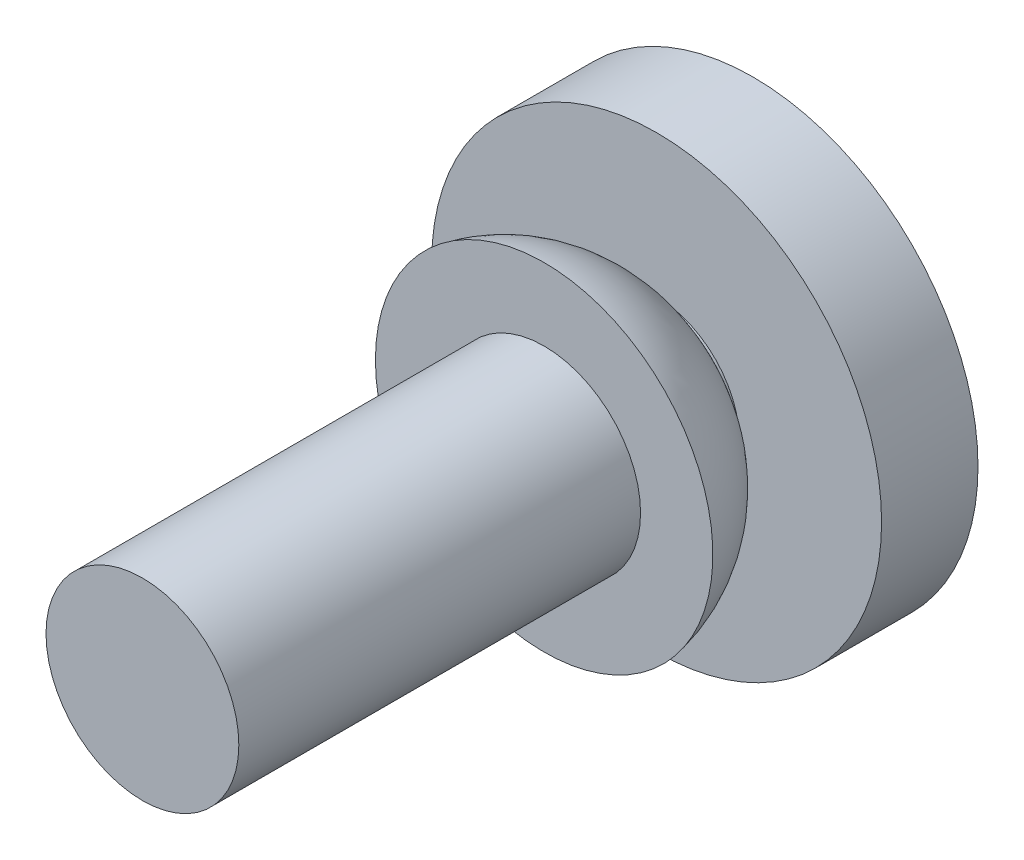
ISO-10303-21;
HEADER;
FILE_DESCRIPTION(('STEP AP214'),'2;1');
FILE_NAME('part.step','',(''),(''),'','','');
FILE_SCHEMA(('AUTOMOTIVE_DESIGN { 1 0 10303 214 1 1 1 1 }'));
ENDSEC;
DATA;
#1=APPLICATION_CONTEXT('core data for automotive mechanical design processes');
#2=APPLICATION_PROTOCOL_DEFINITION('international standard','automotive_design',2000,#1);
#3=PRODUCT_CONTEXT('',#1,'mechanical');
#4=PRODUCT('Part','Part','',(#3));
#5=PRODUCT_RELATED_PRODUCT_CATEGORY('part','',(#4));
#6=PRODUCT_DEFINITION_FORMATION('','',#4);
#7=PRODUCT_DEFINITION_CONTEXT('part definition',#1,'design');
#8=PRODUCT_DEFINITION('design','',#6,#7);
#9=PRODUCT_DEFINITION_SHAPE('','',#8);
#10=(LENGTH_UNIT() NAMED_UNIT(*) SI_UNIT(.MILLI.,.METRE.));
#11=(NAMED_UNIT(*) PLANE_ANGLE_UNIT() SI_UNIT($,.RADIAN.));
#12=(NAMED_UNIT(*) SI_UNIT($,.STERADIAN.) SOLID_ANGLE_UNIT());
#13=UNCERTAINTY_MEASURE_WITH_UNIT(LENGTH_MEASURE(1.E-05),#10,'distance_accuracy_value','');
#14=(GEOMETRIC_REPRESENTATION_CONTEXT(3) GLOBAL_UNCERTAINTY_ASSIGNED_CONTEXT((#13)) GLOBAL_UNIT_ASSIGNED_CONTEXT((#10,
#11,#12)) REPRESENTATION_CONTEXT('',''));
#15=CARTESIAN_POINT('',(0.,0.,0.));
#16=DIRECTION('',(0.,0.,1.));
#17=DIRECTION('',(1.,0.,0.));
#18=AXIS2_PLACEMENT_3D('',#15,#16,#17);
#19=CARTESIAN_POINT('',(0.,6.,0.));
#20=DIRECTION('',(0.,0.,-1.));
#21=DIRECTION('',(-1.,0.,0.));
#22=AXIS2_PLACEMENT_3D('',#19,#20,#21);
#23=PLANE('',#22);
#24=CARTESIAN_POINT('',(0.,0.,0.));
#25=DIRECTION('',(0.,0.,-1.));
#26=DIRECTION('',(0.,1.,0.));
#27=AXIS2_PLACEMENT_3D('',#24,#25,#26);
#28=CIRCLE('',#27,6.);
#29=CARTESIAN_POINT('',(0.,6.,0.));
#30=VERTEX_POINT('',#29);
#31=EDGE_CURVE('E10',#30,#30,#28,.F.);
#32=ORIENTED_EDGE('',*,*,#31,.T.);
#33=EDGE_LOOP('',(#32));
#34=FACE_BOUND('',#33,.T.);
#35=ADVANCED_FACE('F15',(#34),#23,.F.);
#36=CARTESIAN_POINT('',(0.,0.,-32.));
#37=DIRECTION('',(0.,0.,1.));
#38=DIRECTION('',(0.,-1.,0.));
#39=AXIS2_PLACEMENT_3D('',#36,#37,#38);
#40=PLANE('',#39);
#41=CARTESIAN_POINT('',(0.,0.,-32.));
#42=DIRECTION('',(0.,0.,1.));
#43=DIRECTION('',(0.,-1.,0.));
#44=AXIS2_PLACEMENT_3D('',#41,#42,#43);
#45=CIRCLE('',#44,14.);
#46=CARTESIAN_POINT('',(0.,-14.,-32.));
#47=VERTEX_POINT('',#46);
#48=EDGE_CURVE('E31',#47,#47,#45,.T.);
#49=ORIENTED_EDGE('',*,*,#48,.T.);
#50=EDGE_LOOP('',(#49));
#51=FACE_BOUND('',#50,.T.);
#52=CARTESIAN_POINT('',(0.,0.,-32.));
#53=DIRECTION('',(0.,0.,1.));
#54=DIRECTION('',(0.,-1.,0.));
#55=AXIS2_PLACEMENT_3D('',#52,#53,#54);
#56=CIRCLE('',#55,5.15);
#57=CARTESIAN_POINT('',(0.,-5.15,-32.));
#58=VERTEX_POINT('',#57);
#59=EDGE_CURVE('E41',#58,#58,#56,.T.);
#60=ORIENTED_EDGE('',*,*,#59,.F.);
#61=EDGE_LOOP('',(#60));
#62=FACE_BOUND('',#61,.T.);
#63=ADVANCED_FACE('F55',(#51,#62),#40,.T.);
#64=CARTESIAN_POINT('',(0.,0.,-38.));
#65=DIRECTION('',(0.,0.,1.));
#66=DIRECTION('',(0.,-1.,0.));
#67=AXIS2_PLACEMENT_3D('',#64,#65,#66);
#68=PLANE('',#67);
#69=CARTESIAN_POINT('',(0.,0.,-38.));
#70=DIRECTION('',(0.,0.,1.));
#71=DIRECTION('',(0.,-1.,0.));
#72=AXIS2_PLACEMENT_3D('',#69,#70,#71);
#73=CIRCLE('',#72,14.);
#74=CARTESIAN_POINT('',(0.,-14.,-38.));
#75=VERTEX_POINT('',#74);
#76=EDGE_CURVE('E26',#75,#75,#73,.T.);
#77=ORIENTED_EDGE('',*,*,#76,.F.);
#78=EDGE_LOOP('',(#77));
#79=FACE_BOUND('',#78,.T.);
#80=CARTESIAN_POINT('',(0.,0.,-38.));
#81=DIRECTION('',(0.,0.,1.));
#82=DIRECTION('',(0.,-1.,0.));
#83=AXIS2_PLACEMENT_3D('',#80,#81,#82);
#84=CIRCLE('',#83,3.4);
#85=CARTESIAN_POINT('',(0.,-3.4,-38.));
#86=VERTEX_POINT('',#85);
#87=EDGE_CURVE('E22',#86,#86,#84,.T.);
#88=ORIENTED_EDGE('',*,*,#87,.T.);
#89=EDGE_LOOP('',(#88));
#90=FACE_BOUND('',#89,.T.);
#91=ADVANCED_FACE('F62',(#79,#90),#68,.F.);
#92=CARTESIAN_POINT('',(0.,0.,-32.));
#93=DIRECTION('',(0.,0.,-1.));
#94=DIRECTION('',(0.,1.,0.));
#95=AXIS2_PLACEMENT_3D('',#92,#93,#94);
#96=CYLINDRICAL_SURFACE('',#95,14.);
#97=ORIENTED_EDGE('',*,*,#48,.F.);
#98=EDGE_LOOP('',(#97));
#99=FACE_BOUND('',#98,.T.);
#100=ORIENTED_EDGE('',*,*,#76,.T.);
#101=EDGE_LOOP('',(#100));
#102=FACE_BOUND('',#101,.T.);
#103=ADVANCED_FACE('F58',(#99,#102),#96,.T.);
#104=CARTESIAN_POINT('',(0.,0.,-32.));
#105=DIRECTION('',(0.,0.,1.));
#106=DIRECTION('',(0.,-1.,0.));
#107=AXIS2_PLACEMENT_3D('',#104,#105,#106);
#108=CYLINDRICAL_SURFACE('',#107,3.4);
#109=ORIENTED_EDGE('',*,*,#87,.F.);
#110=EDGE_LOOP('',(#109));
#111=FACE_BOUND('',#110,.T.);
#112=CARTESIAN_POINT('',(0.,0.,-31.6));
#113=DIRECTION('',(0.,0.,-1.));
#114=DIRECTION('',(0.,1.,0.));
#115=AXIS2_PLACEMENT_3D('',#112,#113,#114);
#116=CIRCLE('',#115,3.4);
#117=CARTESIAN_POINT('',(0.,3.4,-31.6));
#118=VERTEX_POINT('',#117);
#119=EDGE_CURVE('E36',#118,#118,#116,.T.);
#120=ORIENTED_EDGE('',*,*,#119,.F.);
#121=EDGE_LOOP('',(#120));
#122=FACE_BOUND('',#121,.T.);
#123=ADVANCED_FACE('F61',(#111,#122),#108,.F.);
#124=CARTESIAN_POINT('',(0.,0.,-46.5663996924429));
#125=DIRECTION('',(0.,0.,1.));
#126=DIRECTION('',(0.,-1.,0.));
#127=AXIS2_PLACEMENT_3D('',#124,#125,#126);
#128=CYLINDRICAL_SURFACE('',#127,5.15);
#129=ORIENTED_EDGE('',*,*,#59,.T.);
#130=EDGE_LOOP('',(#129));
#131=FACE_BOUND('',#130,.T.);
#132=CARTESIAN_POINT('',(0.,0.,-31.6));
#133=DIRECTION('',(0.,0.,-1.));
#134=DIRECTION('',(-1.,0.,0.));
#135=AXIS2_PLACEMENT_3D('',#132,#133,#134);
#136=CIRCLE('',#135,5.15);
#137=CARTESIAN_POINT('',(-5.15,0.,-31.6));
#138=VERTEX_POINT('',#137);
#139=EDGE_CURVE('E44',#138,#138,#136,.T.);
#140=ORIENTED_EDGE('',*,*,#139,.T.);
#141=EDGE_LOOP('',(#140));
#142=FACE_BOUND('',#141,.T.);
#143=ADVANCED_FACE('F80',(#131,#142),#128,.T.);
#144=CARTESIAN_POINT('',(0.,5.15,-31.6));
#145=DIRECTION('',(0.,0.,1.));
#146=DIRECTION('',(1.,0.,0.));
#147=AXIS2_PLACEMENT_3D('',#144,#145,#146);
#148=PLANE('',#147);
#149=ORIENTED_EDGE('',*,*,#119,.T.);
#150=EDGE_LOOP('',(#149));
#151=FACE_BOUND('',#150,.T.);
#152=ADVANCED_FACE('F86',(#151),#148,.F.);
#153=CARTESIAN_POINT('',(0.,0.,-53.5022613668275));
#154=DIRECTION('',(0.,0.,-1.));
#155=DIRECTION('',(-1.,0.,0.));
#156=AXIS2_PLACEMENT_3D('',#153,#154,#155);
#157=CYLINDRICAL_SURFACE('',#156,6.);
#158=ORIENTED_EDGE('',*,*,#31,.F.);
#159=EDGE_LOOP('',(#158));
#160=FACE_BOUND('',#159,.T.);
#161=CARTESIAN_POINT('',(0.,0.,-25.));
#162=DIRECTION('',(0.,0.,-1.));
#163=DIRECTION('',(0.,1.,0.));
#164=AXIS2_PLACEMENT_3D('',#161,#162,#163);
#165=CIRCLE('',#164,6.);
#166=CARTESIAN_POINT('',(0.,6.,-25.));
#167=VERTEX_POINT('',#166);
#168=EDGE_CURVE('E34',#167,#167,#165,.T.);
#169=ORIENTED_EDGE('',*,*,#168,.F.);
#170=EDGE_LOOP('',(#169));
#171=FACE_BOUND('',#170,.T.);
#172=ADVANCED_FACE('F17',(#160,#171),#157,.T.);
#173=CARTESIAN_POINT('',(0.,10.5,-25.));
#174=DIRECTION('',(0.,0.,-1.));
#175=DIRECTION('',(-1.,0.,0.));
#176=AXIS2_PLACEMENT_3D('',#173,#174,#175);
#177=PLANE('',#176);
#178=ORIENTED_EDGE('',*,*,#168,.T.);
#179=EDGE_LOOP('',(#178));
#180=FACE_BOUND('',#179,.T.);
#181=CARTESIAN_POINT('',(0.,0.,-25.));
#182=DIRECTION('',(0.,0.,-1.));
#183=DIRECTION('',(-1.,0.,0.));
#184=AXIS2_PLACEMENT_3D('',#181,#182,#183);
#185=CIRCLE('',#184,10.5);
#186=CARTESIAN_POINT('',(-10.5,0.,-25.));
#187=VERTEX_POINT('',#186);
#188=EDGE_CURVE('E37',#187,#187,#185,.T.);
#189=ORIENTED_EDGE('',*,*,#188,.F.);
#190=EDGE_LOOP('',(#189));
#191=FACE_BOUND('',#190,.T.);
#192=ADVANCED_FACE('F98',(#180,#191),#177,.F.);
#193=CARTESIAN_POINT('',(0.,0.,-23.2323581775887));
#194=DIRECTION('',(0.,0.,-1.));
#195=DIRECTION('',(-1.,0.,0.));
#196=AXIS2_PLACEMENT_3D('',#193,#194,#195);
#197=DEGENERATE_TOROIDAL_SURFACE('',#196,1.57332971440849,9.1,.T.);
#198=ORIENTED_EDGE('',*,*,#139,.F.);
#199=EDGE_LOOP('',(#198));
#200=FACE_BOUND('',#199,.T.);
#201=ORIENTED_EDGE('',*,*,#188,.T.);
#202=EDGE_LOOP('',(#201));
#203=FACE_BOUND('',#202,.T.);
#204=ADVANCED_FACE('F101',(#200,#203),#197,.T.);
#205=CLOSED_SHELL('',(#35,#63,#91,#103,#123,#143,#152,#172,#192,#204));
#206=MANIFOLD_SOLID_BREP('B1',#205);
#207=ADVANCED_BREP_SHAPE_REPRESENTATION('',(#18,#206),#14);
#208=SHAPE_DEFINITION_REPRESENTATION(#9,#207);
ENDSEC;
END-ISO-10303-21;
